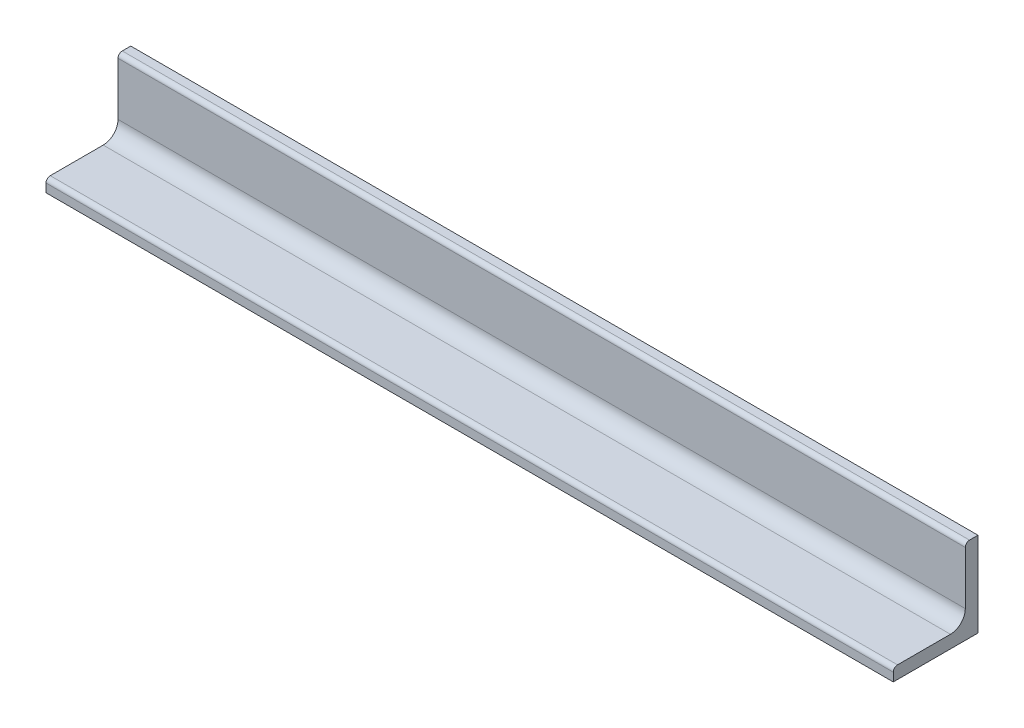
from build123d import *

# Parameters (mm, degrees)
BASE_DEPTH = 200


with BuildPart() as part:
    # Sketch1 → Base (new body)
    with BuildSketch(Plane.YZ):
        with BuildLine():
            Line((0, 20), (0, 0))
            Line((0, 0), (20, 0))
            Line((20, 0), (20, 2))
            ThreePointArc((20, 2), (19.707106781, 2.707106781), (19, 3))
            Line((19, 3), (6.5, 3))
            ThreePointArc((6.5, 3), (4.025126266, 4.025126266), (3, 6.5))
            Line((3, 6.5), (3, 19))
            ThreePointArc((3, 19), (2.707106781, 19.707106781), (2, 20))
            Line((2, 20), (0, 20))
        make_face()
    extrude(amount=BASE_DEPTH)


solid = part.part
